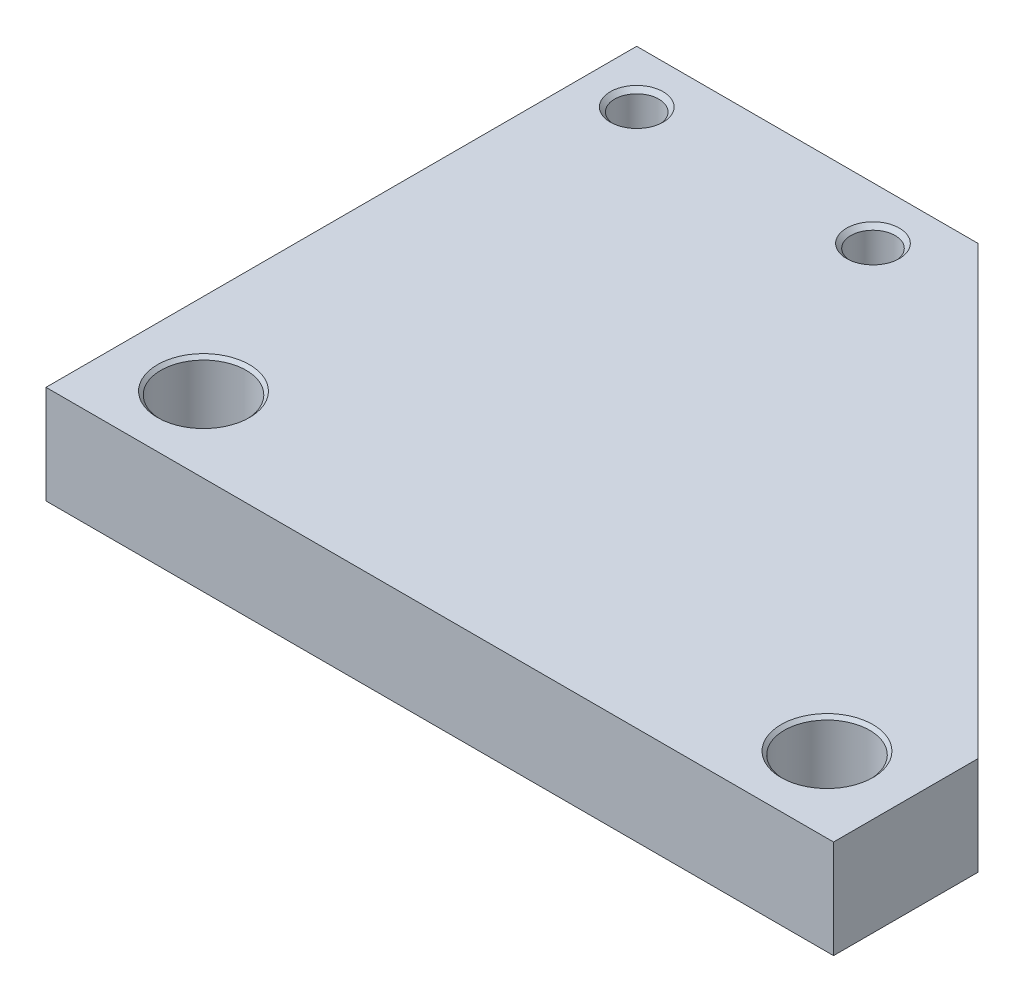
ISO-10303-21;
HEADER;
FILE_DESCRIPTION(('STEP AP214'),'2;1');
FILE_NAME('part.step','',(''),(''),'','','');
FILE_SCHEMA(('AUTOMOTIVE_DESIGN { 1 0 10303 214 1 1 1 1 }'));
ENDSEC;
DATA;
#1=APPLICATION_CONTEXT('core data for automotive mechanical design processes');
#2=APPLICATION_PROTOCOL_DEFINITION('international standard','automotive_design',2000,#1);
#3=PRODUCT_CONTEXT('',#1,'mechanical');
#4=PRODUCT('Part','Part','',(#3));
#5=PRODUCT_RELATED_PRODUCT_CATEGORY('part','',(#4));
#6=PRODUCT_DEFINITION_FORMATION('','',#4);
#7=PRODUCT_DEFINITION_CONTEXT('part definition',#1,'design');
#8=PRODUCT_DEFINITION('design','',#6,#7);
#9=PRODUCT_DEFINITION_SHAPE('','',#8);
#10=(LENGTH_UNIT() NAMED_UNIT(*) SI_UNIT(.MILLI.,.METRE.));
#11=(NAMED_UNIT(*) PLANE_ANGLE_UNIT() SI_UNIT($,.RADIAN.));
#12=(NAMED_UNIT(*) SI_UNIT($,.STERADIAN.) SOLID_ANGLE_UNIT());
#13=UNCERTAINTY_MEASURE_WITH_UNIT(LENGTH_MEASURE(1.E-05),#10,'distance_accuracy_value','');
#14=(GEOMETRIC_REPRESENTATION_CONTEXT(3) GLOBAL_UNCERTAINTY_ASSIGNED_CONTEXT((#13)) GLOBAL_UNIT_ASSIGNED_CONTEXT((#10,
#11,#12)) REPRESENTATION_CONTEXT('',''));
#15=CARTESIAN_POINT('',(0.,0.,0.));
#16=DIRECTION('',(0.,0.,1.));
#17=DIRECTION('',(1.,0.,0.));
#18=AXIS2_PLACEMENT_3D('',#15,#16,#17);
#19=CARTESIAN_POINT('',(-120.000000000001,15.0000000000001,0.0100000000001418));
#20=DIRECTION('',(1.00000000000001,0.,0.));
#21=DIRECTION('',(0.,0.,-1.00000000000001));
#22=AXIS2_PLACEMENT_3D('',#19,#20,#21);
#23=PLANE('',#22);
#24=DIRECTION('',(0.,0.,1.00000000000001));
#25=VECTOR('',#24,1.);
#26=CARTESIAN_POINT('',(-120.000000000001,0.,0.0100000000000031));
#27=LINE('',#26,#25);
#28=CARTESIAN_POINT('',(-120.000000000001,0.,0.0100000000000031));
#29=VERTEX_POINT('',#28);
#30=CARTESIAN_POINT('',(-120.,0.,90.0000000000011));
#31=VERTEX_POINT('',#30);
#32=EDGE_CURVE('E128',#29,#31,#27,.T.);
#33=ORIENTED_EDGE('',*,*,#32,.T.);
#34=DIRECTION('',(0.,-1.,0.));
#35=VECTOR('',#34,1.);
#36=CARTESIAN_POINT('',(-120.,15.0000000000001,90.0000000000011));
#37=LINE('',#36,#35);
#38=CARTESIAN_POINT('',(-120.,15.0000000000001,90.0000000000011));
#39=VERTEX_POINT('',#38);
#40=EDGE_CURVE('E11',#39,#31,#37,.T.);
#41=ORIENTED_EDGE('',*,*,#40,.F.);
#42=DIRECTION('',(0.,0.,1.00000000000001));
#43=VECTOR('',#42,1.);
#44=CARTESIAN_POINT('',(-120.000000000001,15.0000000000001,0.0100000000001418));
#45=LINE('',#44,#43);
#46=CARTESIAN_POINT('',(-120.000000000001,15.0000000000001,0.0100000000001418));
#47=VERTEX_POINT('',#46);
#48=EDGE_CURVE('E139',#47,#39,#45,.T.);
#49=ORIENTED_EDGE('',*,*,#48,.F.);
#50=DIRECTION('',(0.,-1.,0.));
#51=VECTOR('',#50,1.);
#52=CARTESIAN_POINT('',(-120.000000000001,15.0000000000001,0.0100000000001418));
#53=LINE('',#52,#51);
#54=EDGE_CURVE('E124',#47,#29,#53,.T.);
#55=ORIENTED_EDGE('',*,*,#54,.T.);
#56=EDGE_LOOP('',(#33,#41,#49,#55));
#57=FACE_BOUND('',#56,.T.);
#58=ADVANCED_FACE('F44',(#57),#23,.F.);
#59=CARTESIAN_POINT('',(0.,15.0000000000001,90.0000000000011));
#60=DIRECTION('',(0.,0.,-1.00000000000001));
#61=DIRECTION('',(-1.00000000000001,0.,0.));
#62=AXIS2_PLACEMENT_3D('',#59,#60,#61);
#63=PLANE('',#62);
#64=DIRECTION('',(1.00000000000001,0.,0.));
#65=VECTOR('',#64,1.);
#66=CARTESIAN_POINT('',(0.,1.38777878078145E-13,90.0000000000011));
#67=LINE('',#66,#65);
#68=CARTESIAN_POINT('',(0.,1.38777878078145E-13,90.0000000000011));
#69=VERTEX_POINT('',#68);
#70=EDGE_CURVE('E131',#31,#69,#67,.T.);
#71=ORIENTED_EDGE('',*,*,#70,.T.);
#72=DIRECTION('',(0.,-1.,0.));
#73=VECTOR('',#72,1.);
#74=CARTESIAN_POINT('',(0.,15.0000000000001,90.0000000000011));
#75=LINE('',#74,#73);
#76=CARTESIAN_POINT('',(0.,15.0000000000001,90.0000000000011));
#77=VERTEX_POINT('',#76);
#78=EDGE_CURVE('E52',#77,#69,#75,.T.);
#79=ORIENTED_EDGE('',*,*,#78,.F.);
#80=DIRECTION('',(1.00000000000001,0.,0.));
#81=VECTOR('',#80,1.);
#82=CARTESIAN_POINT('',(0.,15.0000000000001,90.0000000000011));
#83=LINE('',#82,#81);
#84=EDGE_CURVE('E97',#39,#77,#83,.T.);
#85=ORIENTED_EDGE('',*,*,#84,.F.);
#86=ORIENTED_EDGE('',*,*,#40,.T.);
#87=EDGE_LOOP('',(#71,#79,#85,#86));
#88=FACE_BOUND('',#87,.T.);
#89=ADVANCED_FACE('F164',(#88),#63,.F.);
#90=CARTESIAN_POINT('',(0.,15.0000000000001,67.9900000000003));
#91=DIRECTION('',(-1.00000000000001,0.,0.));
#92=DIRECTION('',(0.,0.,1.00000000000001));
#93=AXIS2_PLACEMENT_3D('',#90,#91,#92);
#94=PLANE('',#93);
#95=DIRECTION('',(0.,0.,-1.00000000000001));
#96=VECTOR('',#95,1.);
#97=CARTESIAN_POINT('',(0.,0.,67.9899999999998));
#98=LINE('',#97,#96);
#99=CARTESIAN_POINT('',(0.,0.,67.9899999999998));
#100=VERTEX_POINT('',#99);
#101=EDGE_CURVE('E134',#69,#100,#98,.T.);
#102=ORIENTED_EDGE('',*,*,#101,.T.);
#103=DIRECTION('',(0.,-1.,0.));
#104=VECTOR('',#103,1.);
#105=CARTESIAN_POINT('',(0.,15.0000000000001,67.9900000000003));
#106=LINE('',#105,#104);
#107=CARTESIAN_POINT('',(0.,15.0000000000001,67.9900000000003));
#108=VERTEX_POINT('',#107);
#109=EDGE_CURVE('E119',#108,#100,#106,.T.);
#110=ORIENTED_EDGE('',*,*,#109,.F.);
#111=DIRECTION('',(0.,0.,-1.00000000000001));
#112=VECTOR('',#111,1.);
#113=CARTESIAN_POINT('',(0.,15.0000000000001,67.9900000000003));
#114=LINE('',#113,#112);
#115=EDGE_CURVE('E110',#77,#108,#114,.T.);
#116=ORIENTED_EDGE('',*,*,#115,.F.);
#117=ORIENTED_EDGE('',*,*,#78,.T.);
#118=EDGE_LOOP('',(#102,#110,#116,#117));
#119=FACE_BOUND('',#118,.T.);
#120=ADVANCED_FACE('F145',(#119),#94,.F.);
#121=CARTESIAN_POINT('',(-67.99,15.,0.));
#122=DIRECTION('',(-0.707106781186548,0.,0.707106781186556));
#123=DIRECTION('',(0.707106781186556,0.,0.707106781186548));
#124=AXIS2_PLACEMENT_3D('',#121,#122,#123);
#125=PLANE('',#124);
#126=DIRECTION('',(-0.707106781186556,0.,-0.707106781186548));
#127=VECTOR('',#126,1.);
#128=CARTESIAN_POINT('',(-67.99,1.38777878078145E-13,0.));
#129=LINE('',#128,#127);
#130=CARTESIAN_POINT('',(-67.99,1.38777878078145E-13,0.));
#131=VERTEX_POINT('',#130);
#132=EDGE_CURVE('E118',#100,#131,#129,.T.);
#133=ORIENTED_EDGE('',*,*,#132,.T.);
#134=DIRECTION('',(0.,-1.,0.));
#135=VECTOR('',#134,1.);
#136=CARTESIAN_POINT('',(-67.99,15.,0.));
#137=LINE('',#136,#135);
#138=CARTESIAN_POINT('',(-67.99,15.,0.));
#139=VERTEX_POINT('',#138);
#140=EDGE_CURVE('E115',#139,#131,#137,.T.);
#141=ORIENTED_EDGE('',*,*,#140,.F.);
#142=DIRECTION('',(-0.707106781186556,0.,-0.707106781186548));
#143=VECTOR('',#142,1.);
#144=CARTESIAN_POINT('',(-67.99,15.,0.));
#145=LINE('',#144,#143);
#146=EDGE_CURVE('E104',#108,#139,#145,.T.);
#147=ORIENTED_EDGE('',*,*,#146,.F.);
#148=ORIENTED_EDGE('',*,*,#109,.T.);
#149=EDGE_LOOP('',(#133,#141,#147,#148));
#150=FACE_BOUND('',#149,.T.);
#151=ADVANCED_FACE('F116',(#150),#125,.F.);
#152=CARTESIAN_POINT('',(-67.99,15.,0.));
#153=DIRECTION('',(0.,0.,1.00000000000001));
#154=DIRECTION('',(1.00000000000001,0.,0.));
#155=AXIS2_PLACEMENT_3D('',#152,#153,#154);
#156=PLANE('',#155);
#157=DIRECTION('',(-1.00000000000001,0.,0.));
#158=VECTOR('',#157,1.);
#159=CARTESIAN_POINT('',(-67.99,1.38777878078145E-13,0.));
#160=LINE('',#159,#158);
#161=CARTESIAN_POINT('',(-119.990000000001,0.,0.));
#162=VERTEX_POINT('',#161);
#163=EDGE_CURVE('E83',#131,#162,#160,.T.);
#164=ORIENTED_EDGE('',*,*,#163,.T.);
#165=DIRECTION('',(0.,-1.,0.));
#166=VECTOR('',#165,1.);
#167=CARTESIAN_POINT('',(-119.990000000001,15.0000000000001,1.45716771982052E-13));
#168=LINE('',#167,#166);
#169=CARTESIAN_POINT('',(-119.990000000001,15.0000000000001,1.45716771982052E-13));
#170=VERTEX_POINT('',#169);
#171=EDGE_CURVE('E120',#170,#162,#168,.T.);
#172=ORIENTED_EDGE('',*,*,#171,.F.);
#173=DIRECTION('',(-1.00000000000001,0.,0.));
#174=VECTOR('',#173,1.);
#175=CARTESIAN_POINT('',(-67.99,15.,0.));
#176=LINE('',#175,#174);
#177=EDGE_CURVE('E108',#139,#170,#176,.T.);
#178=ORIENTED_EDGE('',*,*,#177,.F.);
#179=ORIENTED_EDGE('',*,*,#140,.T.);
#180=EDGE_LOOP('',(#164,#172,#178,#179));
#181=FACE_BOUND('',#180,.T.);
#182=ADVANCED_FACE('F122',(#181),#156,.F.);
#183=CARTESIAN_POINT('',(-120.000000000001,15.0000000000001,0.0100000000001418));
#184=DIRECTION('',(0.707106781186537,0.,0.707106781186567));
#185=DIRECTION('',(0.707106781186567,0.,-0.707106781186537));
#186=AXIS2_PLACEMENT_3D('',#183,#184,#185);
#187=PLANE('',#186);
#188=DIRECTION('',(-0.707106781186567,0.,0.707106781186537));
#189=VECTOR('',#188,1.);
#190=CARTESIAN_POINT('',(-120.000000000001,0.,0.0100000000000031));
#191=LINE('',#190,#189);
#192=EDGE_CURVE('E89',#162,#29,#191,.T.);
#193=ORIENTED_EDGE('',*,*,#192,.T.);
#194=ORIENTED_EDGE('',*,*,#54,.F.);
#195=DIRECTION('',(-0.707106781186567,0.,0.707106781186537));
#196=VECTOR('',#195,1.);
#197=CARTESIAN_POINT('',(-120.000000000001,15.0000000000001,0.0100000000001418));
#198=LINE('',#197,#196);
#199=EDGE_CURVE('E60',#170,#47,#198,.T.);
#200=ORIENTED_EDGE('',*,*,#199,.F.);
#201=ORIENTED_EDGE('',*,*,#171,.T.);
#202=EDGE_LOOP('',(#193,#194,#200,#201));
#203=FACE_BOUND('',#202,.T.);
#204=ADVANCED_FACE('F152',(#203),#187,.F.);
#205=CARTESIAN_POINT('',(0.,15.,0.));
#206=DIRECTION('',(0.,-1.,0.));
#207=DIRECTION('',(0.,0.,-1.00000000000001));
#208=AXIS2_PLACEMENT_3D('',#205,#206,#207);
#209=PLANE('',#208);
#210=CARTESIAN_POINT('',(-107.5,15.0000000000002,78.5000000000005));
#211=DIRECTION('',(0.,1.,0.));
#212=DIRECTION('',(0.,0.,1.00000000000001));
#213=AXIS2_PLACEMENT_3D('',#210,#211,#212);
#214=CIRCLE('',#213,6.99999999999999);
#215=CARTESIAN_POINT('',(-107.5,15.0000000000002,85.5000000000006));
#216=VERTEX_POINT('',#215);
#217=EDGE_CURVE('E302',#216,#216,#214,.T.);
#218=ORIENTED_EDGE('',*,*,#217,.F.);
#219=EDGE_LOOP('',(#218));
#220=FACE_BOUND('',#219,.T.);
#221=CARTESIAN_POINT('',(-12.5,15.0000000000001,78.5000000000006));
#222=DIRECTION('',(0.,1.,0.));
#223=DIRECTION('',(0.,0.,1.00000000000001));
#224=AXIS2_PLACEMENT_3D('',#221,#222,#223);
#225=CIRCLE('',#224,7.);
#226=CARTESIAN_POINT('',(-12.5,15.0000000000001,85.5000000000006));
#227=VERTEX_POINT('',#226);
#228=EDGE_CURVE('E315',#227,#227,#225,.T.);
#229=ORIENTED_EDGE('',*,*,#228,.F.);
#230=EDGE_LOOP('',(#229));
#231=FACE_BOUND('',#230,.T.);
#232=CARTESIAN_POINT('',(-111.99,15.0000000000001,8.00000000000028));
#233=DIRECTION('',(0.,1.,0.));
#234=DIRECTION('',(0.,0.,1.00000000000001));
#235=AXIS2_PLACEMENT_3D('',#232,#233,#234);
#236=CIRCLE('',#235,4.025);
#237=CARTESIAN_POINT('',(-111.99,15.0000000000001,12.0250000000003));
#238=VERTEX_POINT('',#237);
#239=EDGE_CURVE('E327',#238,#238,#236,.T.);
#240=ORIENTED_EDGE('',*,*,#239,.F.);
#241=EDGE_LOOP('',(#240));
#242=FACE_BOUND('',#241,.T.);
#243=CARTESIAN_POINT('',(-75.99,15.,8.00000000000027));
#244=DIRECTION('',(0.,1.,0.));
#245=DIRECTION('',(0.,0.,1.00000000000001));
#246=AXIS2_PLACEMENT_3D('',#243,#244,#245);
#247=CIRCLE('',#246,4.025);
#248=CARTESIAN_POINT('',(-75.99,15.,12.0250000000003));
#249=VERTEX_POINT('',#248);
#250=EDGE_CURVE('E339',#249,#249,#247,.T.);
#251=ORIENTED_EDGE('',*,*,#250,.F.);
#252=EDGE_LOOP('',(#251));
#253=FACE_BOUND('',#252,.T.);
#254=ORIENTED_EDGE('',*,*,#48,.T.);
#255=ORIENTED_EDGE('',*,*,#84,.T.);
#256=ORIENTED_EDGE('',*,*,#115,.T.);
#257=ORIENTED_EDGE('',*,*,#146,.T.);
#258=ORIENTED_EDGE('',*,*,#177,.T.);
#259=ORIENTED_EDGE('',*,*,#199,.T.);
#260=EDGE_LOOP('',(#254,#255,#256,#257,#258,#259));
#261=FACE_BOUND('',#260,.T.);
#262=ADVANCED_FACE('F106',(#220,#231,#242,#253,#261),#209,.F.);
#263=CARTESIAN_POINT('',(0.,0.,0.));
#264=DIRECTION('',(0.,-1.,0.));
#265=DIRECTION('',(0.,0.,-1.00000000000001));
#266=AXIS2_PLACEMENT_3D('',#263,#264,#265);
#267=PLANE('',#266);
#268=CARTESIAN_POINT('',(-107.5,1.38777878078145E-13,78.5000000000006));
#269=DIRECTION('',(0.,1.,0.));
#270=DIRECTION('',(0.,0.,1.00000000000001));
#271=AXIS2_PLACEMENT_3D('',#268,#269,#270);
#272=CIRCLE('',#271,6.99999999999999);
#273=CARTESIAN_POINT('',(-107.5,1.38777878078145E-13,85.5000000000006));
#274=VERTEX_POINT('',#273);
#275=EDGE_CURVE('E303',#274,#274,#272,.T.);
#276=ORIENTED_EDGE('',*,*,#275,.T.);
#277=EDGE_LOOP('',(#276));
#278=FACE_BOUND('',#277,.T.);
#279=CARTESIAN_POINT('',(-12.5,2.63677968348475E-13,78.5000000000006));
#280=DIRECTION('',(0.,1.,0.));
#281=DIRECTION('',(0.,0.,1.00000000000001));
#282=AXIS2_PLACEMENT_3D('',#279,#280,#281);
#283=CIRCLE('',#282,7.);
#284=CARTESIAN_POINT('',(-12.5,2.63677968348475E-13,85.5000000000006));
#285=VERTEX_POINT('',#284);
#286=EDGE_CURVE('E312',#285,#285,#283,.T.);
#287=ORIENTED_EDGE('',*,*,#286,.T.);
#288=EDGE_LOOP('',(#287));
#289=FACE_BOUND('',#288,.T.);
#290=CARTESIAN_POINT('',(-111.99,0.,8.00000000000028));
#291=DIRECTION('',(0.,1.,0.));
#292=DIRECTION('',(0.,0.,1.00000000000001));
#293=AXIS2_PLACEMENT_3D('',#290,#291,#292);
#294=CIRCLE('',#293,4.025);
#295=CARTESIAN_POINT('',(-111.99,0.,12.0250000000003));
#296=VERTEX_POINT('',#295);
#297=EDGE_CURVE('E324',#296,#296,#294,.T.);
#298=ORIENTED_EDGE('',*,*,#297,.T.);
#299=EDGE_LOOP('',(#298));
#300=FACE_BOUND('',#299,.T.);
#301=CARTESIAN_POINT('',(-75.99,1.2490009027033E-13,8.00000000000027));
#302=DIRECTION('',(0.,1.,0.));
#303=DIRECTION('',(0.,0.,1.00000000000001));
#304=AXIS2_PLACEMENT_3D('',#301,#302,#303);
#305=CIRCLE('',#304,4.025);
#306=CARTESIAN_POINT('',(-75.99,1.2490009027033E-13,12.0250000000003));
#307=VERTEX_POINT('',#306);
#308=EDGE_CURVE('E336',#307,#307,#305,.T.);
#309=ORIENTED_EDGE('',*,*,#308,.T.);
#310=EDGE_LOOP('',(#309));
#311=FACE_BOUND('',#310,.T.);
#312=ORIENTED_EDGE('',*,*,#32,.F.);
#313=ORIENTED_EDGE('',*,*,#192,.F.);
#314=ORIENTED_EDGE('',*,*,#163,.F.);
#315=ORIENTED_EDGE('',*,*,#132,.F.);
#316=ORIENTED_EDGE('',*,*,#101,.F.);
#317=ORIENTED_EDGE('',*,*,#70,.F.);
#318=EDGE_LOOP('',(#312,#313,#314,#315,#316,#317));
#319=FACE_BOUND('',#318,.T.);
#320=ADVANCED_FACE('F148',(#278,#289,#300,#311,#319),#267,.T.);
#321=CARTESIAN_POINT('',(-75.99,0.65000000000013,8.00000000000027));
#322=DIRECTION('',(0.,-1.,0.));
#323=DIRECTION('',(0.,0.,-1.00000000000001));
#324=AXIS2_PLACEMENT_3D('',#321,#322,#323);
#325=CONICAL_SURFACE('',#324,3.375,0.785398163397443);
#326=ORIENTED_EDGE('',*,*,#308,.F.);
#327=EDGE_LOOP('',(#326));
#328=FACE_BOUND('',#327,.T.);
#329=CARTESIAN_POINT('',(-75.99,0.65000000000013,8.00000000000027));
#330=DIRECTION('',(0.,1.,0.));
#331=DIRECTION('',(0.,0.,1.00000000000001));
#332=AXIS2_PLACEMENT_3D('',#329,#330,#331);
#333=CIRCLE('',#332,3.375);
#334=CARTESIAN_POINT('',(-75.99,0.65000000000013,11.3750000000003));
#335=VERTEX_POINT('',#334);
#336=EDGE_CURVE('E132',#335,#335,#333,.T.);
#337=ORIENTED_EDGE('',*,*,#336,.T.);
#338=EDGE_LOOP('',(#337));
#339=FACE_BOUND('',#338,.T.);
#340=ADVANCED_FACE('F195',(#328,#339),#325,.F.);
#341=CARTESIAN_POINT('',(-75.99,15.,8.00000000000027));
#342=DIRECTION('',(0.,1.,0.));
#343=DIRECTION('',(0.,0.,1.00000000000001));
#344=AXIS2_PLACEMENT_3D('',#341,#342,#343);
#345=CYLINDRICAL_SURFACE('',#344,3.375);
#346=ORIENTED_EDGE('',*,*,#336,.F.);
#347=EDGE_LOOP('',(#346));
#348=FACE_BOUND('',#347,.T.);
#349=CARTESIAN_POINT('',(-75.99,14.35,8.00000000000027));
#350=DIRECTION('',(0.,1.,0.));
#351=DIRECTION('',(0.,0.,1.00000000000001));
#352=AXIS2_PLACEMENT_3D('',#349,#350,#351);
#353=CIRCLE('',#352,3.375);
#354=CARTESIAN_POINT('',(-75.99,14.35,11.3750000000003));
#355=VERTEX_POINT('',#354);
#356=EDGE_CURVE('E342',#355,#355,#353,.T.);
#357=ORIENTED_EDGE('',*,*,#356,.T.);
#358=EDGE_LOOP('',(#357));
#359=FACE_BOUND('',#358,.T.);
#360=ADVANCED_FACE('F202',(#348,#359),#345,.F.);
#361=CARTESIAN_POINT('',(-75.99,15.,8.00000000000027));
#362=DIRECTION('',(0.,1.,0.));
#363=DIRECTION('',(0.,0.,1.00000000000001));
#364=AXIS2_PLACEMENT_3D('',#361,#362,#363);
#365=CONICAL_SURFACE('',#364,4.025,0.785398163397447);
#366=ORIENTED_EDGE('',*,*,#356,.F.);
#367=EDGE_LOOP('',(#366));
#368=FACE_BOUND('',#367,.T.);
#369=ORIENTED_EDGE('',*,*,#250,.T.);
#370=EDGE_LOOP('',(#369));
#371=FACE_BOUND('',#370,.T.);
#372=ADVANCED_FACE('F211',(#368,#371),#365,.F.);
#373=CARTESIAN_POINT('',(-111.99,0.650000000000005,8.00000000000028));
#374=DIRECTION('',(0.,-1.,0.));
#375=DIRECTION('',(0.,0.,-1.00000000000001));
#376=AXIS2_PLACEMENT_3D('',#373,#374,#375);
#377=CONICAL_SURFACE('',#376,3.375,0.785398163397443);
#378=ORIENTED_EDGE('',*,*,#297,.F.);
#379=EDGE_LOOP('',(#378));
#380=FACE_BOUND('',#379,.T.);
#381=CARTESIAN_POINT('',(-111.99,0.650000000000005,8.00000000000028));
#382=DIRECTION('',(0.,1.,0.));
#383=DIRECTION('',(0.,0.,1.00000000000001));
#384=AXIS2_PLACEMENT_3D('',#381,#382,#383);
#385=CIRCLE('',#384,3.375);
#386=CARTESIAN_POINT('',(-111.99,0.650000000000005,11.3750000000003));
#387=VERTEX_POINT('',#386);
#388=EDGE_CURVE('E333',#387,#387,#385,.T.);
#389=ORIENTED_EDGE('',*,*,#388,.T.);
#390=EDGE_LOOP('',(#389));
#391=FACE_BOUND('',#390,.T.);
#392=ADVANCED_FACE('F221',(#380,#391),#377,.F.);
#393=CARTESIAN_POINT('',(-111.99,15.0000000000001,8.00000000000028));
#394=DIRECTION('',(0.,1.,0.));
#395=DIRECTION('',(0.,0.,1.00000000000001));
#396=AXIS2_PLACEMENT_3D('',#393,#394,#395);
#397=CYLINDRICAL_SURFACE('',#396,3.375);
#398=ORIENTED_EDGE('',*,*,#388,.F.);
#399=EDGE_LOOP('',(#398));
#400=FACE_BOUND('',#399,.T.);
#401=CARTESIAN_POINT('',(-111.99,14.3500000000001,8.00000000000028));
#402=DIRECTION('',(0.,1.,0.));
#403=DIRECTION('',(0.,0.,1.00000000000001));
#404=AXIS2_PLACEMENT_3D('',#401,#402,#403);
#405=CIRCLE('',#404,3.375);
#406=CARTESIAN_POINT('',(-111.99,14.3500000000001,11.3750000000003));
#407=VERTEX_POINT('',#406);
#408=EDGE_CURVE('E330',#407,#407,#405,.T.);
#409=ORIENTED_EDGE('',*,*,#408,.T.);
#410=EDGE_LOOP('',(#409));
#411=FACE_BOUND('',#410,.T.);
#412=ADVANCED_FACE('F229',(#400,#411),#397,.F.);
#413=CARTESIAN_POINT('',(-111.99,15.0000000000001,8.00000000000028));
#414=DIRECTION('',(0.,1.,0.));
#415=DIRECTION('',(0.,0.,1.00000000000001));
#416=AXIS2_PLACEMENT_3D('',#413,#414,#415);
#417=CONICAL_SURFACE('',#416,4.025,0.785398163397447);
#418=ORIENTED_EDGE('',*,*,#408,.F.);
#419=EDGE_LOOP('',(#418));
#420=FACE_BOUND('',#419,.T.);
#421=ORIENTED_EDGE('',*,*,#239,.T.);
#422=EDGE_LOOP('',(#421));
#423=FACE_BOUND('',#422,.T.);
#424=ADVANCED_FACE('F237',(#420,#423),#417,.F.);
#425=CARTESIAN_POINT('',(-12.5,0.500000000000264,78.5000000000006));
#426=DIRECTION('',(0.,-1.,0.));
#427=DIRECTION('',(0.,0.,-1.00000000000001));
#428=AXIS2_PLACEMENT_3D('',#425,#426,#427);
#429=CONICAL_SURFACE('',#428,6.5,0.785398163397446);
#430=ORIENTED_EDGE('',*,*,#286,.F.);
#431=EDGE_LOOP('',(#430));
#432=FACE_BOUND('',#431,.T.);
#433=CARTESIAN_POINT('',(-12.5,0.500000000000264,78.5000000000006));
#434=DIRECTION('',(0.,1.,0.));
#435=DIRECTION('',(0.,0.,1.00000000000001));
#436=AXIS2_PLACEMENT_3D('',#433,#434,#435);
#437=CIRCLE('',#436,6.5);
#438=CARTESIAN_POINT('',(-12.5,0.500000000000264,85.0000000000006));
#439=VERTEX_POINT('',#438);
#440=EDGE_CURVE('E321',#439,#439,#437,.T.);
#441=ORIENTED_EDGE('',*,*,#440,.T.);
#442=EDGE_LOOP('',(#441));
#443=FACE_BOUND('',#442,.T.);
#444=ADVANCED_FACE('F246',(#432,#443),#429,.F.);
#445=CARTESIAN_POINT('',(-12.5,15.0000000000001,78.5000000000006));
#446=DIRECTION('',(0.,1.,0.));
#447=DIRECTION('',(0.,0.,1.00000000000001));
#448=AXIS2_PLACEMENT_3D('',#445,#446,#447);
#449=CYLINDRICAL_SURFACE('',#448,6.5);
#450=ORIENTED_EDGE('',*,*,#440,.F.);
#451=EDGE_LOOP('',(#450));
#452=FACE_BOUND('',#451,.T.);
#453=CARTESIAN_POINT('',(-12.5,14.5000000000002,78.5000000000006));
#454=DIRECTION('',(0.,1.,0.));
#455=DIRECTION('',(0.,0.,1.00000000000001));
#456=AXIS2_PLACEMENT_3D('',#453,#454,#455);
#457=CIRCLE('',#456,6.5);
#458=CARTESIAN_POINT('',(-12.5,14.5000000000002,85.0000000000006));
#459=VERTEX_POINT('',#458);
#460=EDGE_CURVE('E318',#459,#459,#457,.T.);
#461=ORIENTED_EDGE('',*,*,#460,.T.);
#462=EDGE_LOOP('',(#461));
#463=FACE_BOUND('',#462,.T.);
#464=ADVANCED_FACE('F254',(#452,#463),#449,.F.);
#465=CARTESIAN_POINT('',(-12.5,15.0000000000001,78.5000000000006));
#466=DIRECTION('',(0.,1.,0.));
#467=DIRECTION('',(0.,0.,1.00000000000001));
#468=AXIS2_PLACEMENT_3D('',#465,#466,#467);
#469=CONICAL_SURFACE('',#468,7.,0.78539816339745);
#470=ORIENTED_EDGE('',*,*,#460,.F.);
#471=EDGE_LOOP('',(#470));
#472=FACE_BOUND('',#471,.T.);
#473=ORIENTED_EDGE('',*,*,#228,.T.);
#474=EDGE_LOOP('',(#473));
#475=FACE_BOUND('',#474,.T.);
#476=ADVANCED_FACE('F262',(#472,#475),#469,.F.);
#477=CARTESIAN_POINT('',(-107.5,0.500000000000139,78.5000000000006));
#478=DIRECTION('',(0.,-1.,0.));
#479=DIRECTION('',(0.,0.,-1.00000000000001));
#480=AXIS2_PLACEMENT_3D('',#477,#478,#479);
#481=CONICAL_SURFACE('',#480,6.49999999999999,0.785398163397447);
#482=ORIENTED_EDGE('',*,*,#275,.F.);
#483=EDGE_LOOP('',(#482));
#484=FACE_BOUND('',#483,.T.);
#485=CARTESIAN_POINT('',(-107.5,0.500000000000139,78.5000000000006));
#486=DIRECTION('',(0.,1.,0.));
#487=DIRECTION('',(0.,0.,1.00000000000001));
#488=AXIS2_PLACEMENT_3D('',#485,#486,#487);
#489=CIRCLE('',#488,6.49999999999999);
#490=CARTESIAN_POINT('',(-107.5,0.500000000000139,85.0000000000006));
#491=VERTEX_POINT('',#490);
#492=EDGE_CURVE('E305',#491,#491,#489,.T.);
#493=ORIENTED_EDGE('',*,*,#492,.T.);
#494=EDGE_LOOP('',(#493));
#495=FACE_BOUND('',#494,.T.);
#496=ADVANCED_FACE('F270',(#484,#495),#481,.F.);
#497=CARTESIAN_POINT('',(-107.5,15.0000000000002,78.5000000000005));
#498=DIRECTION('',(0.,1.,0.));
#499=DIRECTION('',(0.,0.,1.00000000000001));
#500=AXIS2_PLACEMENT_3D('',#497,#498,#499);
#501=CYLINDRICAL_SURFACE('',#500,6.5);
#502=ORIENTED_EDGE('',*,*,#492,.F.);
#503=EDGE_LOOP('',(#502));
#504=FACE_BOUND('',#503,.T.);
#505=CARTESIAN_POINT('',(-107.5,14.5000000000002,78.5000000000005));
#506=DIRECTION('',(0.,1.,0.));
#507=DIRECTION('',(0.,0.,1.00000000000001));
#508=AXIS2_PLACEMENT_3D('',#505,#506,#507);
#509=CIRCLE('',#508,6.50000000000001);
#510=CARTESIAN_POINT('',(-107.5,14.5000000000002,85.0000000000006));
#511=VERTEX_POINT('',#510);
#512=EDGE_CURVE('E299',#511,#511,#509,.T.);
#513=ORIENTED_EDGE('',*,*,#512,.T.);
#514=EDGE_LOOP('',(#513));
#515=FACE_BOUND('',#514,.T.);
#516=ADVANCED_FACE('F278',(#504,#515),#501,.F.);
#517=CARTESIAN_POINT('',(-107.5,15.0000000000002,78.5000000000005));
#518=DIRECTION('',(0.,1.,0.));
#519=DIRECTION('',(0.,0.,1.00000000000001));
#520=AXIS2_PLACEMENT_3D('',#517,#518,#519);
#521=CONICAL_SURFACE('',#520,6.99999999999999,0.785398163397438);
#522=ORIENTED_EDGE('',*,*,#512,.F.);
#523=EDGE_LOOP('',(#522));
#524=FACE_BOUND('',#523,.T.);
#525=ORIENTED_EDGE('',*,*,#217,.T.);
#526=EDGE_LOOP('',(#525));
#527=FACE_BOUND('',#526,.T.);
#528=ADVANCED_FACE('F286',(#524,#527),#521,.F.);
#529=CLOSED_SHELL('',(#58,#89,#120,#151,#182,#204,#262,#320,#340,#360,#372,#392,#412,#424,#444,
#464,#476,#496,#516,#528));
#530=MANIFOLD_SOLID_BREP('B2',#529);
#531=ADVANCED_BREP_SHAPE_REPRESENTATION('',(#18,#530),#14);
#532=SHAPE_DEFINITION_REPRESENTATION(#9,#531);
ENDSEC;
END-ISO-10303-21;
